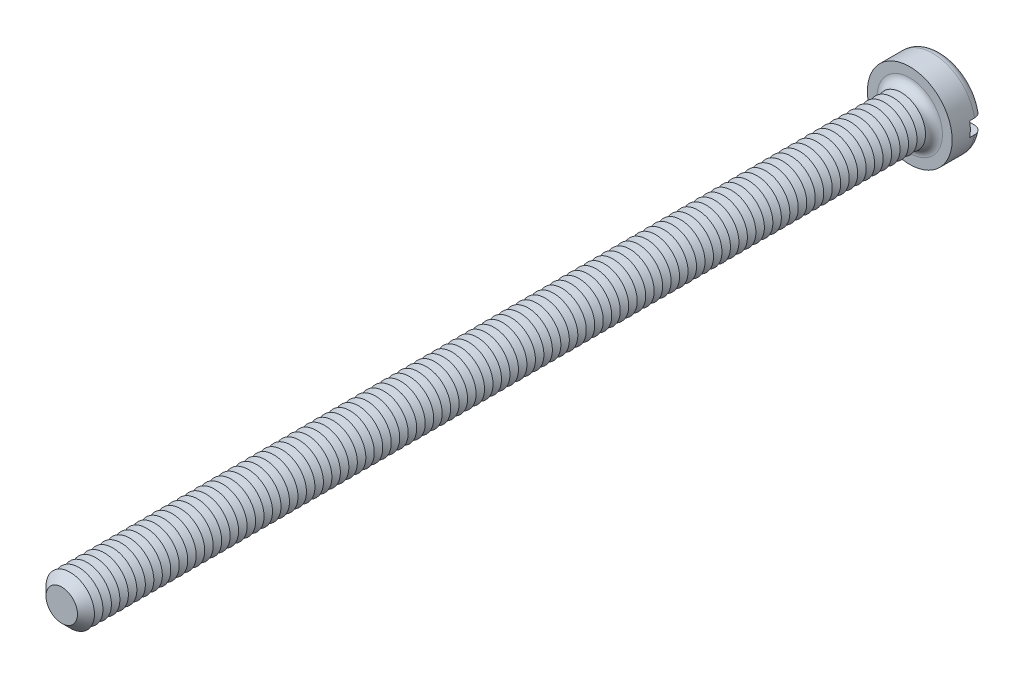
from build123d import *

# Parameters (mm, degrees)
SKETCH3_R           = 3.5
BOSS_EXTRUDE2_DEPTH = 2.6
SKETCH4_R           = 2
BOSS_EXTRUDE3_DEPTH = 70
FILLET1_R           = 0.7
CHAMFER1_SIZE       = 0.7
LPATTERN1_COUNT     = 98
LPATTERN1_PITCH     = 0.7
SKETCH8_W           = 7
SKETCH8_H           = 1.2
CUT_EXTRUDE1_DEPTH  = 1.1


with BuildPart() as part:
    # Sketch3 → Boss-Extrude2 (new body)
    with BuildSketch(Plane.XY):
        Circle(SKETCH3_R)
    extrude(amount=-BOSS_EXTRUDE2_DEPTH)

    # Sketch4 → Boss-Extrude3 (add)
    with BuildSketch(Plane.XY):
        Circle(SKETCH4_R)
    extrude(amount=BOSS_EXTRUDE3_DEPTH)

    # Fillet1
    fillet1_edges = [part.edges().sort_by_distance(p)[0] for p in [
        (-3.5, 0, -2.6),
        (-2, 0, 0),
    ]]
    fillet(fillet1_edges, radius=FILLET1_R)

    # Chamfer1
    chamfer1_edges = [part.edges().sort_by_distance(p)[0] for p in [
        (-2, 0, 70),
    ]]
    chamfer(chamfer1_edges, length=CHAMFER1_SIZE)

    # Sketch6 → Cut-Revolve1 (revolve, cut)
    with BuildSketch(Plane(origin=(0, 0, 0), x_dir=(0, 0, -1), z_dir=(1, 0, 0)), mode=Mode.PRIVATE) as cut_revolve1_sk:
        Polygon((-0.7, 2), (-1.05, 1.393782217), (-1.4, 2), align=None)
    cut_revolve1 = revolve(cut_revolve1_sk.sketch.rotate(Axis((0, 0, -1.694361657), (0, 0, 1)), 90), axis=Axis((0, 0, -1.694361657), (0, 0, 1)), mode=Mode.SUBTRACT)

    # LPattern1: Cut-Revolve1 ×98
    with Locations(*[(0, 0, i * LPATTERN1_PITCH) for i in range(1, LPATTERN1_COUNT)]):
        add(cut_revolve1, mode=Mode.SUBTRACT)

    # Sketch8 → Cut-Extrude1 (cut)
    with BuildSketch(Plane(origin=(0, 0, -2.6), x_dir=(-1, 0, 0), z_dir=(0, 0, -1))):
        Rectangle(SKETCH8_W, SKETCH8_H)
    extrude(amount=-CUT_EXTRUDE1_DEPTH, mode=Mode.SUBTRACT)


solid = part.part
